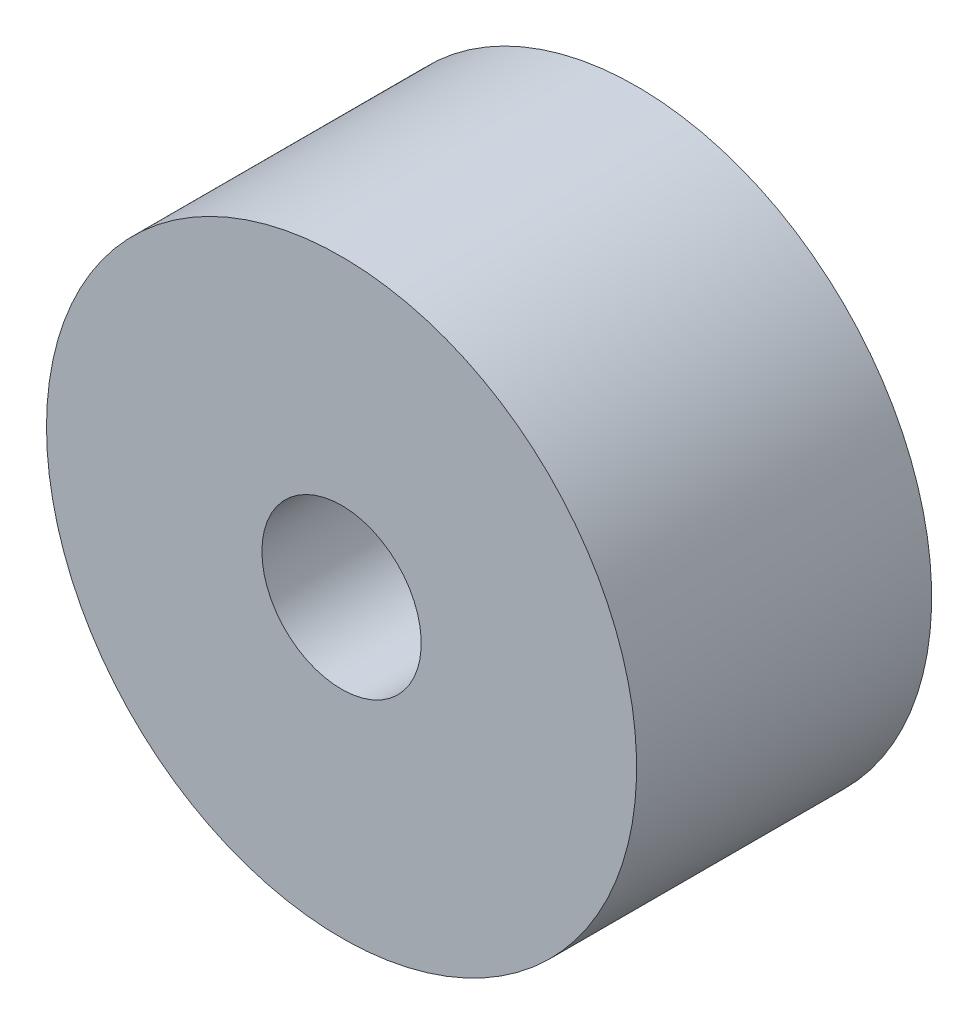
ISO-10303-21;
HEADER;
FILE_DESCRIPTION(('STEP AP214'),'2;1');
FILE_NAME('part.step','',(''),(''),'','','');
FILE_SCHEMA(('AUTOMOTIVE_DESIGN { 1 0 10303 214 1 1 1 1 }'));
ENDSEC;
DATA;
#1=APPLICATION_CONTEXT('core data for automotive mechanical design processes');
#2=APPLICATION_PROTOCOL_DEFINITION('international standard','automotive_design',2000,#1);
#3=PRODUCT_CONTEXT('',#1,'mechanical');
#4=PRODUCT('Part','Part','',(#3));
#5=PRODUCT_RELATED_PRODUCT_CATEGORY('part','',(#4));
#6=PRODUCT_DEFINITION_FORMATION('','',#4);
#7=PRODUCT_DEFINITION_CONTEXT('part definition',#1,'design');
#8=PRODUCT_DEFINITION('design','',#6,#7);
#9=PRODUCT_DEFINITION_SHAPE('','',#8);
#10=(LENGTH_UNIT() NAMED_UNIT(*) SI_UNIT(.MILLI.,.METRE.));
#11=(NAMED_UNIT(*) PLANE_ANGLE_UNIT() SI_UNIT($,.RADIAN.));
#12=(NAMED_UNIT(*) SI_UNIT($,.STERADIAN.) SOLID_ANGLE_UNIT());
#13=UNCERTAINTY_MEASURE_WITH_UNIT(LENGTH_MEASURE(1.E-05),#10,'distance_accuracy_value','');
#14=(GEOMETRIC_REPRESENTATION_CONTEXT(3) GLOBAL_UNCERTAINTY_ASSIGNED_CONTEXT((#13)) GLOBAL_UNIT_ASSIGNED_CONTEXT((#10,
#11,#12)) REPRESENTATION_CONTEXT('',''));
#15=CARTESIAN_POINT('',(0.,0.,0.));
#16=DIRECTION('',(0.,0.,1.));
#17=DIRECTION('',(1.,0.,0.));
#18=AXIS2_PLACEMENT_3D('',#15,#16,#17);
#19=CARTESIAN_POINT('',(12.4930552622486,19.5197897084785,-6.4802201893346));
#20=DIRECTION('',(0.,0.,-1.));
#21=DIRECTION('',(-1.,0.,0.));
#22=AXIS2_PLACEMENT_3D('',#19,#20,#21);
#23=CYLINDRICAL_SURFACE('',#22,5.);
#24=CARTESIAN_POINT('',(12.4930552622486,19.5197897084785,-6.4802201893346));
#25=DIRECTION('',(0.,0.,-1.));
#26=DIRECTION('',(-1.,0.,0.));
#27=AXIS2_PLACEMENT_3D('',#24,#25,#26);
#28=CIRCLE('',#27,5.);
#29=CARTESIAN_POINT('',(7.49305526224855,19.5197897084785,-6.4802201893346));
#30=VERTEX_POINT('',#29);
#31=EDGE_CURVE('E10',#30,#30,#28,.T.);
#32=ORIENTED_EDGE('',*,*,#31,.T.);
#33=EDGE_LOOP('',(#32));
#34=FACE_BOUND('',#33,.T.);
#35=CARTESIAN_POINT('',(12.4930552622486,19.5197897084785,-11.4802201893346));
#36=DIRECTION('',(0.,0.,-1.));
#37=DIRECTION('',(-1.,0.,0.));
#38=AXIS2_PLACEMENT_3D('',#35,#36,#37);
#39=CIRCLE('',#38,5.);
#40=CARTESIAN_POINT('',(7.49305526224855,19.5197897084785,-11.4802201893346));
#41=VERTEX_POINT('',#40);
#42=EDGE_CURVE('E40',#41,#41,#39,.T.);
#43=ORIENTED_EDGE('',*,*,#42,.F.);
#44=EDGE_LOOP('',(#43));
#45=FACE_BOUND('',#44,.T.);
#46=ADVANCED_FACE('F37',(#34,#45),#23,.T.);
#47=CARTESIAN_POINT('',(12.4930552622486,19.5197897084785,-6.4802201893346));
#48=DIRECTION('',(0.,0.,-1.));
#49=DIRECTION('',(-1.,0.,0.));
#50=AXIS2_PLACEMENT_3D('',#47,#48,#49);
#51=PLANE('',#50);
#52=CARTESIAN_POINT('',(12.4930552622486,19.5197897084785,-6.4802201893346));
#53=DIRECTION('',(0.,0.,-1.));
#54=DIRECTION('',(-1.,0.,0.));
#55=AXIS2_PLACEMENT_3D('',#52,#53,#54);
#56=CIRCLE('',#55,1.35);
#57=CARTESIAN_POINT('',(11.1430552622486,19.5197897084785,-6.4802201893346));
#58=VERTEX_POINT('',#57);
#59=EDGE_CURVE('E47',#58,#58,#56,.T.);
#60=ORIENTED_EDGE('',*,*,#59,.T.);
#61=EDGE_LOOP('',(#60));
#62=FACE_BOUND('',#61,.T.);
#63=ORIENTED_EDGE('',*,*,#31,.F.);
#64=EDGE_LOOP('',(#63));
#65=FACE_BOUND('',#64,.T.);
#66=ADVANCED_FACE('F55',(#62,#65),#51,.F.);
#67=CARTESIAN_POINT('',(12.4930552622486,19.5197897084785,-11.4802201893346));
#68=DIRECTION('',(0.,0.,-1.));
#69=DIRECTION('',(-1.,0.,0.));
#70=AXIS2_PLACEMENT_3D('',#67,#68,#69);
#71=PLANE('',#70);
#72=CARTESIAN_POINT('',(12.4930552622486,19.5197897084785,-11.4802201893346));
#73=DIRECTION('',(0.,0.,-1.));
#74=DIRECTION('',(-1.,0.,0.));
#75=AXIS2_PLACEMENT_3D('',#72,#73,#74);
#76=CIRCLE('',#75,1.35);
#77=CARTESIAN_POINT('',(11.1430552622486,19.5197897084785,-11.4802201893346));
#78=VERTEX_POINT('',#77);
#79=EDGE_CURVE('E49',#78,#78,#76,.T.);
#80=ORIENTED_EDGE('',*,*,#79,.F.);
#81=EDGE_LOOP('',(#80));
#82=FACE_BOUND('',#81,.T.);
#83=ORIENTED_EDGE('',*,*,#42,.T.);
#84=EDGE_LOOP('',(#83));
#85=FACE_BOUND('',#84,.T.);
#86=ADVANCED_FACE('F61',(#82,#85),#71,.T.);
#87=CARTESIAN_POINT('',(12.4930552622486,19.5197897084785,-6.4802201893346));
#88=DIRECTION('',(0.,0.,-1.));
#89=DIRECTION('',(-1.,0.,0.));
#90=AXIS2_PLACEMENT_3D('',#87,#88,#89);
#91=CYLINDRICAL_SURFACE('',#90,1.35);
#92=ORIENTED_EDGE('',*,*,#59,.F.);
#93=EDGE_LOOP('',(#92));
#94=FACE_BOUND('',#93,.T.);
#95=ORIENTED_EDGE('',*,*,#79,.T.);
#96=EDGE_LOOP('',(#95));
#97=FACE_BOUND('',#96,.T.);
#98=ADVANCED_FACE('F58',(#94,#97),#91,.F.);
#99=CLOSED_SHELL('',(#46,#66,#86,#98));
#100=MANIFOLD_SOLID_BREP('B2',#99);
#101=ADVANCED_BREP_SHAPE_REPRESENTATION('',(#18,#100),#14);
#102=SHAPE_DEFINITION_REPRESENTATION(#9,#101);
ENDSEC;
END-ISO-10303-21;
